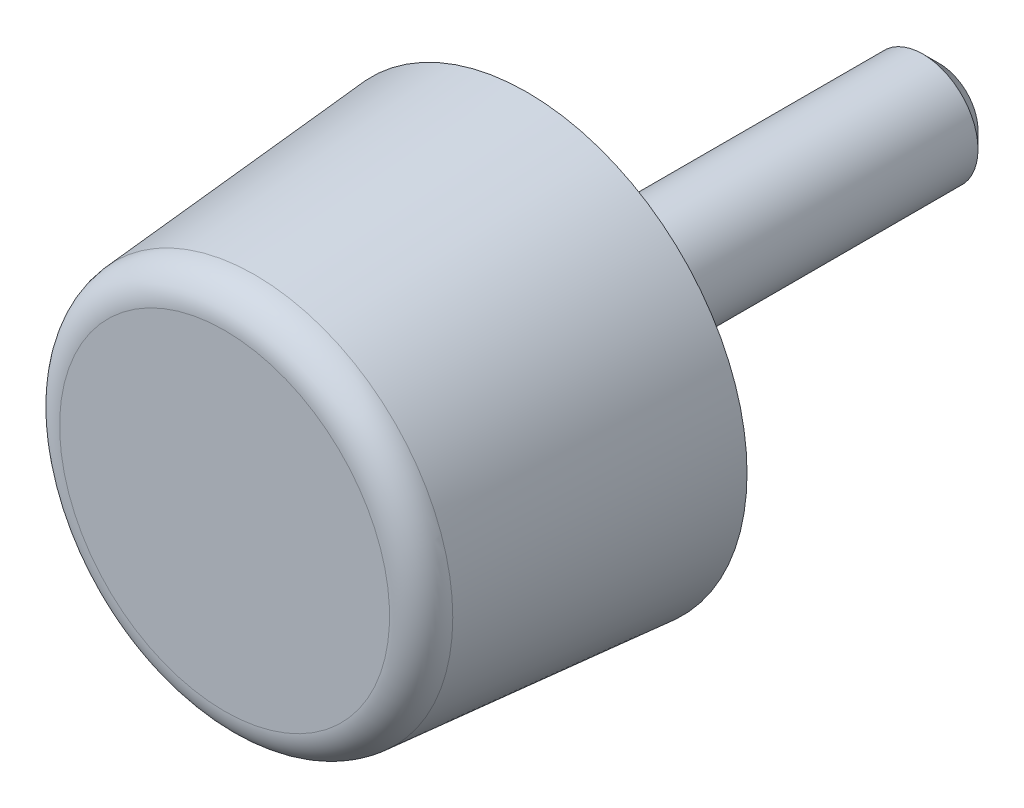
ISO-10303-21;
HEADER;
FILE_DESCRIPTION(('STEP AP214'),'2;1');
FILE_NAME('part.step','',(''),(''),'','','');
FILE_SCHEMA(('AUTOMOTIVE_DESIGN { 1 0 10303 214 1 1 1 1 }'));
ENDSEC;
DATA;
#1=APPLICATION_CONTEXT('core data for automotive mechanical design processes');
#2=APPLICATION_PROTOCOL_DEFINITION('international standard','automotive_design',2000,#1);
#3=PRODUCT_CONTEXT('',#1,'mechanical');
#4=PRODUCT('Part','Part','',(#3));
#5=PRODUCT_RELATED_PRODUCT_CATEGORY('part','',(#4));
#6=PRODUCT_DEFINITION_FORMATION('','',#4);
#7=PRODUCT_DEFINITION_CONTEXT('part definition',#1,'design');
#8=PRODUCT_DEFINITION('design','',#6,#7);
#9=PRODUCT_DEFINITION_SHAPE('','',#8);
#10=(LENGTH_UNIT() NAMED_UNIT(*) SI_UNIT(.MILLI.,.METRE.));
#11=(NAMED_UNIT(*) PLANE_ANGLE_UNIT() SI_UNIT($,.RADIAN.));
#12=(NAMED_UNIT(*) SI_UNIT($,.STERADIAN.) SOLID_ANGLE_UNIT());
#13=UNCERTAINTY_MEASURE_WITH_UNIT(LENGTH_MEASURE(1.E-05),#10,'distance_accuracy_value','');
#14=(GEOMETRIC_REPRESENTATION_CONTEXT(3) GLOBAL_UNCERTAINTY_ASSIGNED_CONTEXT((#13)) GLOBAL_UNIT_ASSIGNED_CONTEXT((#10,
#11,#12)) REPRESENTATION_CONTEXT('',''));
#15=CARTESIAN_POINT('',(0.,0.,0.));
#16=DIRECTION('',(0.,0.,1.));
#17=DIRECTION('',(1.,0.,0.));
#18=AXIS2_PLACEMENT_3D('',#15,#16,#17);
#19=CARTESIAN_POINT('',(0.,0.,22.));
#20=DIRECTION('',(0.,0.,1.));
#21=DIRECTION('',(0.,-1.,0.));
#22=AXIS2_PLACEMENT_3D('',#19,#20,#21);
#23=CYLINDRICAL_SURFACE('',#22,14.4);
#24=CARTESIAN_POINT('',(0.,0.,0.));
#25=DIRECTION('',(0.,0.,1.));
#26=DIRECTION('',(0.,-1.,0.));
#27=AXIS2_PLACEMENT_3D('',#24,#25,#26);
#28=CIRCLE('',#27,14.4);
#29=CARTESIAN_POINT('',(0.,-14.4,0.));
#30=VERTEX_POINT('',#29);
#31=EDGE_CURVE('E27',#30,#30,#28,.T.);
#32=ORIENTED_EDGE('',*,*,#31,.F.);
#33=EDGE_LOOP('',(#32));
#34=FACE_BOUND('',#33,.T.);
#35=CARTESIAN_POINT('',(0.,0.,0.049999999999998));
#36=DIRECTION('',(0.,0.,1.));
#37=DIRECTION('',(0.,-1.,0.));
#38=AXIS2_PLACEMENT_3D('',#35,#36,#37);
#39=CIRCLE('',#38,14.4);
#40=CARTESIAN_POINT('',(0.,-14.4,0.049999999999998));
#41=VERTEX_POINT('',#40);
#42=EDGE_CURVE('E44',#41,#41,#39,.T.);
#43=ORIENTED_EDGE('',*,*,#42,.T.);
#44=EDGE_LOOP('',(#43));
#45=FACE_BOUND('',#44,.T.);
#46=ADVANCED_FACE('F12',(#34,#45),#23,.F.);
#47=CARTESIAN_POINT('',(14.4,0.,0.));
#48=DIRECTION('',(0.,0.,1.));
#49=DIRECTION('',(0.,-1.,0.));
#50=AXIS2_PLACEMENT_3D('',#47,#48,#49);
#51=PLANE('',#50);
#52=CARTESIAN_POINT('',(0.,0.,0.));
#53=DIRECTION('',(0.,0.,1.));
#54=DIRECTION('',(0.,-1.,0.));
#55=AXIS2_PLACEMENT_3D('',#52,#53,#54);
#56=CIRCLE('',#55,16.);
#57=CARTESIAN_POINT('',(0.,-16.,0.));
#58=VERTEX_POINT('',#57);
#59=EDGE_CURVE('E32',#58,#58,#56,.T.);
#60=ORIENTED_EDGE('',*,*,#59,.F.);
#61=EDGE_LOOP('',(#60));
#62=FACE_BOUND('',#61,.T.);
#63=ORIENTED_EDGE('',*,*,#31,.T.);
#64=EDGE_LOOP('',(#63));
#65=FACE_BOUND('',#64,.T.);
#66=ADVANCED_FACE('F72',(#62,#65),#51,.F.);
#67=CARTESIAN_POINT('',(0.,0.,0.));
#68=DIRECTION('',(0.,0.,-1.));
#69=DIRECTION('',(0.,1.,0.));
#70=AXIS2_PLACEMENT_3D('',#67,#68,#69);
#71=CONICAL_SURFACE('',#70,16.,0.0810513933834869);
#72=CARTESIAN_POINT('',(0.,0.,19.7943104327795));
#73=DIRECTION('',(0.,0.,1.));
#74=DIRECTION('',(0.,-1.,0.));
#75=AXIS2_PLACEMENT_3D('',#72,#73,#74);
#76=CIRCLE('',#75,14.3921211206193);
#77=CARTESIAN_POINT('',(0.,-14.3921211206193,19.7943104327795));
#78=VERTEX_POINT('',#77);
#79=EDGE_CURVE('E35',#78,#78,#76,.T.);
#80=ORIENTED_EDGE('',*,*,#79,.F.);
#81=EDGE_LOOP('',(#80));
#82=FACE_BOUND('',#81,.T.);
#83=ORIENTED_EDGE('',*,*,#59,.T.);
#84=EDGE_LOOP('',(#83));
#85=FACE_BOUND('',#84,.T.);
#86=ADVANCED_FACE('F77',(#82,#85),#71,.T.);
#87=CARTESIAN_POINT('',(0.,0.,19.6));
#88=DIRECTION('',(0.,0.,1.));
#89=DIRECTION('',(0.,-1.,0.));
#90=AXIS2_PLACEMENT_3D('',#87,#88,#89);
#91=TOROIDAL_SURFACE('',#90,12.,2.4);
#92=ORIENTED_EDGE('',*,*,#79,.T.);
#93=EDGE_LOOP('',(#92));
#94=FACE_BOUND('',#93,.T.);
#95=CARTESIAN_POINT('',(0.,0.,22.));
#96=DIRECTION('',(0.,0.,1.));
#97=DIRECTION('',(0.,-1.,0.));
#98=AXIS2_PLACEMENT_3D('',#95,#96,#97);
#99=CIRCLE('',#98,12.);
#100=CARTESIAN_POINT('',(0.,-12.,22.));
#101=VERTEX_POINT('',#100);
#102=EDGE_CURVE('E38',#101,#101,#99,.T.);
#103=ORIENTED_EDGE('',*,*,#102,.F.);
#104=EDGE_LOOP('',(#103));
#105=FACE_BOUND('',#104,.T.);
#106=ADVANCED_FACE('F84',(#94,#105),#91,.T.);
#107=CARTESIAN_POINT('',(12.,0.,22.));
#108=DIRECTION('',(0.,0.,-1.));
#109=DIRECTION('',(0.,1.,0.));
#110=AXIS2_PLACEMENT_3D('',#107,#108,#109);
#111=PLANE('',#110);
#112=ORIENTED_EDGE('',*,*,#102,.T.);
#113=EDGE_LOOP('',(#112));
#114=FACE_BOUND('',#113,.T.);
#115=ADVANCED_FACE('F59',(#114),#111,.F.);
#116=CARTESIAN_POINT('',(0.,0.,0.));
#117=DIRECTION('',(0.,0.,1.));
#118=DIRECTION('',(0.,-1.,0.));
#119=AXIS2_PLACEMENT_3D('',#116,#117,#118);
#120=PLANE('',#119);
#121=CARTESIAN_POINT('',(0.,0.,0.));
#122=DIRECTION('',(0.,0.,1.));
#123=DIRECTION('',(0.,-1.,0.));
#124=AXIS2_PLACEMENT_3D('',#121,#122,#123);
#125=CIRCLE('',#124,14.35);
#126=CARTESIAN_POINT('',(0.,-14.35,0.));
#127=VERTEX_POINT('',#126);
#128=EDGE_CURVE('E41',#127,#127,#125,.T.);
#129=ORIENTED_EDGE('',*,*,#128,.F.);
#130=EDGE_LOOP('',(#129));
#131=FACE_BOUND('',#130,.T.);
#132=CARTESIAN_POINT('',(0.,0.,0.));
#133=DIRECTION('',(0.,0.,1.));
#134=DIRECTION('',(0.,-1.,0.));
#135=AXIS2_PLACEMENT_3D('',#132,#133,#134);
#136=CIRCLE('',#135,4.);
#137=CARTESIAN_POINT('',(0.,-4.,0.));
#138=VERTEX_POINT('',#137);
#139=EDGE_CURVE('E23',#138,#138,#136,.T.);
#140=ORIENTED_EDGE('',*,*,#139,.T.);
#141=EDGE_LOOP('',(#140));
#142=FACE_BOUND('',#141,.T.);
#143=ADVANCED_FACE('F53',(#131,#142),#120,.F.);
#144=CARTESIAN_POINT('',(0.,0.,0.));
#145=DIRECTION('',(0.,0.,1.));
#146=DIRECTION('',(0.,-1.,0.));
#147=AXIS2_PLACEMENT_3D('',#144,#145,#146);
#148=CONICAL_SURFACE('',#147,14.35,0.785398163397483);
#149=ORIENTED_EDGE('',*,*,#42,.F.);
#150=EDGE_LOOP('',(#149));
#151=FACE_BOUND('',#150,.T.);
#152=ORIENTED_EDGE('',*,*,#128,.T.);
#153=EDGE_LOOP('',(#152));
#154=FACE_BOUND('',#153,.T.);
#155=ADVANCED_FACE('F49',(#151,#154),#148,.T.);
#156=CARTESIAN_POINT('',(0.,0.,22.));
#157=DIRECTION('',(0.,0.,1.));
#158=DIRECTION('',(0.,-1.,0.));
#159=AXIS2_PLACEMENT_3D('',#156,#157,#158);
#160=CYLINDRICAL_SURFACE('',#159,4.);
#161=CARTESIAN_POINT('',(0.,0.,-28.8));
#162=DIRECTION('',(0.,0.,-1.));
#163=DIRECTION('',(0.,1.,0.));
#164=AXIS2_PLACEMENT_3D('',#161,#162,#163);
#165=CIRCLE('',#164,4.);
#166=CARTESIAN_POINT('',(0.,4.,-28.8));
#167=VERTEX_POINT('',#166);
#168=EDGE_CURVE('E8',#167,#167,#165,.F.);
#169=ORIENTED_EDGE('',*,*,#168,.T.);
#170=EDGE_LOOP('',(#169));
#171=FACE_BOUND('',#170,.T.);
#172=ORIENTED_EDGE('',*,*,#139,.F.);
#173=EDGE_LOOP('',(#172));
#174=FACE_BOUND('',#173,.T.);
#175=ADVANCED_FACE('F52',(#171,#174),#160,.T.);
#176=CARTESIAN_POINT('',(0.,0.,-30.));
#177=DIRECTION('',(0.,0.,-1.));
#178=DIRECTION('',(0.,1.,0.));
#179=AXIS2_PLACEMENT_3D('',#176,#177,#178);
#180=PLANE('',#179);
#181=CARTESIAN_POINT('',(0.,0.,-30.));
#182=DIRECTION('',(0.,0.,-1.));
#183=DIRECTION('',(0.,1.,0.));
#184=AXIS2_PLACEMENT_3D('',#181,#182,#183);
#185=CIRCLE('',#184,2.8);
#186=CARTESIAN_POINT('',(0.,2.8,-30.));
#187=VERTEX_POINT('',#186);
#188=EDGE_CURVE('E19',#187,#187,#185,.T.);
#189=ORIENTED_EDGE('',*,*,#188,.T.);
#190=EDGE_LOOP('',(#189));
#191=FACE_BOUND('',#190,.T.);
#192=ADVANCED_FACE('F64',(#191),#180,.T.);
#193=CARTESIAN_POINT('',(0.,0.,-30.));
#194=DIRECTION('',(0.,0.,1.));
#195=DIRECTION('',(0.,-1.,0.));
#196=AXIS2_PLACEMENT_3D('',#193,#194,#195);
#197=CONICAL_SURFACE('',#196,2.8,0.785398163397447);
#198=ORIENTED_EDGE('',*,*,#168,.F.);
#199=EDGE_LOOP('',(#198));
#200=FACE_BOUND('',#199,.T.);
#201=ORIENTED_EDGE('',*,*,#188,.F.);
#202=EDGE_LOOP('',(#201));
#203=FACE_BOUND('',#202,.T.);
#204=ADVANCED_FACE('F14',(#200,#203),#197,.T.);
#205=CLOSED_SHELL('',(#46,#66,#86,#106,#115,#143,#155,#175,#192,#204));
#206=MANIFOLD_SOLID_BREP('B1',#205);
#207=ADVANCED_BREP_SHAPE_REPRESENTATION('',(#18,#206),#14);
#208=SHAPE_DEFINITION_REPRESENTATION(#9,#207);
ENDSEC;
END-ISO-10303-21;
